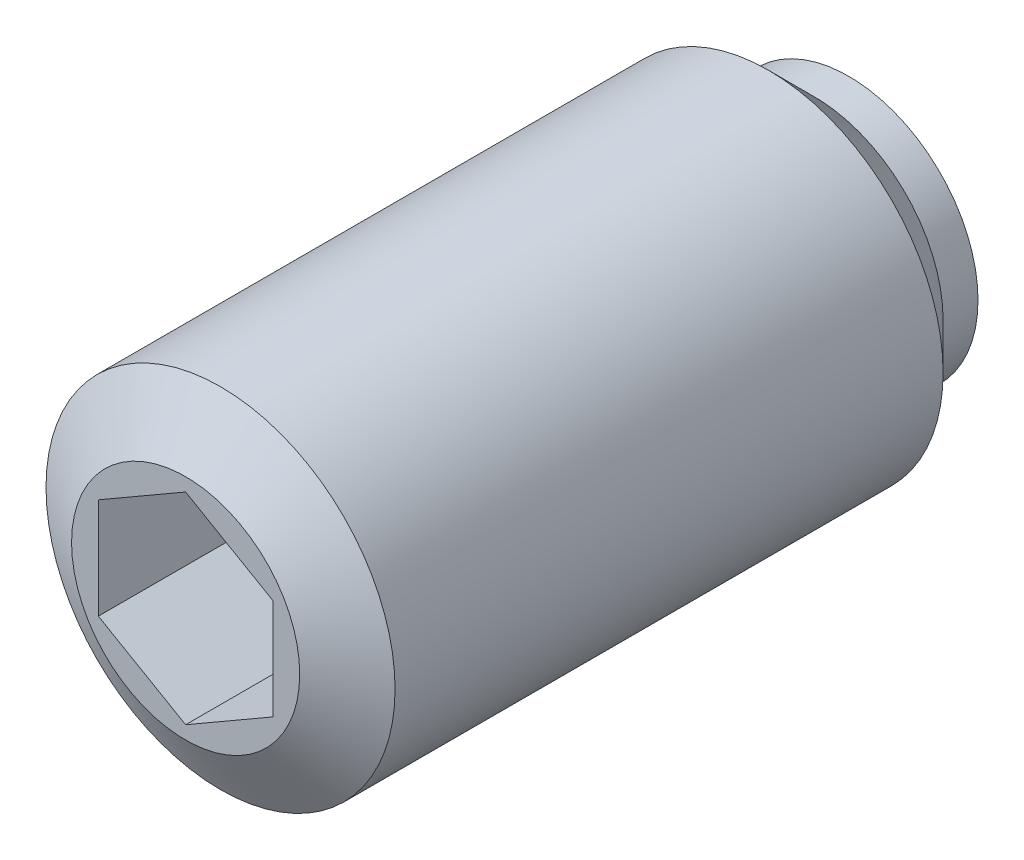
ISO-10303-21;
HEADER;
FILE_DESCRIPTION(('STEP AP214'),'2;1');
FILE_NAME('part.step','',(''),(''),'','','');
FILE_SCHEMA(('AUTOMOTIVE_DESIGN { 1 0 10303 214 1 1 1 1 }'));
ENDSEC;
DATA;
#1=APPLICATION_CONTEXT('core data for automotive mechanical design processes');
#2=APPLICATION_PROTOCOL_DEFINITION('international standard','automotive_design',2000,#1);
#3=PRODUCT_CONTEXT('',#1,'mechanical');
#4=PRODUCT('Part','Part','',(#3));
#5=PRODUCT_RELATED_PRODUCT_CATEGORY('part','',(#4));
#6=PRODUCT_DEFINITION_FORMATION('','',#4);
#7=PRODUCT_DEFINITION_CONTEXT('part definition',#1,'design');
#8=PRODUCT_DEFINITION('design','',#6,#7);
#9=PRODUCT_DEFINITION_SHAPE('','',#8);
#10=(LENGTH_UNIT() NAMED_UNIT(*) SI_UNIT(.MILLI.,.METRE.));
#11=(NAMED_UNIT(*) PLANE_ANGLE_UNIT() SI_UNIT($,.RADIAN.));
#12=(NAMED_UNIT(*) SI_UNIT($,.STERADIAN.) SOLID_ANGLE_UNIT());
#13=UNCERTAINTY_MEASURE_WITH_UNIT(LENGTH_MEASURE(1.E-05),#10,'distance_accuracy_value','');
#14=(GEOMETRIC_REPRESENTATION_CONTEXT(3) GLOBAL_UNCERTAINTY_ASSIGNED_CONTEXT((#13)) GLOBAL_UNIT_ASSIGNED_CONTEXT((#10,
#11,#12)) REPRESENTATION_CONTEXT('',''));
#15=CARTESIAN_POINT('',(0.,0.,0.));
#16=DIRECTION('',(0.,0.,1.));
#17=DIRECTION('',(1.,0.,0.));
#18=AXIS2_PLACEMENT_3D('',#15,#16,#17);
#19=CARTESIAN_POINT('',(0.,1.01980390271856,0.));
#20=DIRECTION('',(0.,0.,1.));
#21=DIRECTION('',(-1.,0.,0.));
#22=AXIS2_PLACEMENT_3D('',#19,#20,#21);
#23=PLANE('',#22);
#24=CARTESIAN_POINT('',(0.,0.,0.));
#25=DIRECTION('',(0.,0.,1.));
#26=DIRECTION('',(-1.,0.,0.));
#27=AXIS2_PLACEMENT_3D('',#24,#25,#26);
#28=CIRCLE('',#27,1.01980390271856);
#29=CARTESIAN_POINT('',(0.,1.01980390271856,0.));
#30=VERTEX_POINT('',#29);
#31=EDGE_CURVE('E9',#30,#30,#28,.T.);
#32=ORIENTED_EDGE('',*,*,#31,.F.);
#33=EDGE_LOOP('',(#32));
#34=FACE_BOUND('',#33,.T.);
#35=ADVANCED_FACE('F14',(#34),#23,.F.);
#36=CARTESIAN_POINT('',(0.,0.,1.1));
#37=DIRECTION('',(0.,0.,1.));
#38=DIRECTION('',(0.,1.,0.));
#39=AXIS2_PLACEMENT_3D('',#36,#37,#38);
#40=SPHERICAL_SURFACE('',#39,1.5);
#41=CARTESIAN_POINT('',(0.,0.,0.3));
#42=DIRECTION('',(0.,0.,1.));
#43=DIRECTION('',(-1.,0.,0.));
#44=AXIS2_PLACEMENT_3D('',#41,#42,#43);
#45=CIRCLE('',#44,1.26885775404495);
#46=CARTESIAN_POINT('',(0.,1.26885775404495,0.3));
#47=VERTEX_POINT('',#46);
#48=EDGE_CURVE('E21',#47,#47,#45,.T.);
#49=CARTESIAN_POINT('',(0.,1.26885775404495,0.3));
#50=CARTESIAN_POINT('',(0.,1.26668545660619,0.296554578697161));
#51=CARTESIAN_POINT('',(0.,1.26449912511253,0.293118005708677));
#52=CARTESIAN_POINT('',(0.,1.26009854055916,0.286262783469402));
#53=CARTESIAN_POINT('',(0.,1.25788428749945,0.28284413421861));
#54=CARTESIAN_POINT('',(0.,1.25342800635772,0.276024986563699));
#55=CARTESIAN_POINT('',(0.,1.2511859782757,0.27262448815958));
#56=CARTESIAN_POINT('',(0.,1.24667429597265,0.265841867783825));
#57=CARTESIAN_POINT('',(0.,1.24440464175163,0.26245974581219));
#58=CARTESIAN_POINT('',(0.,1.23983785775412,0.255714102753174));
#59=CARTESIAN_POINT('',(0.,1.23754072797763,0.252350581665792));
#60=CARTESIAN_POINT('',(0.,1.23291914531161,0.245642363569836));
#61=CARTESIAN_POINT('',(0.,1.23059469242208,0.242297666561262));
#62=CARTESIAN_POINT('',(0.,1.22591861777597,0.235627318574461));
#63=CARTESIAN_POINT('',(0.,1.2235669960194,0.232301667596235));
#64=CARTESIAN_POINT('',(0.,1.21883673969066,0.225669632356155));
#65=CARTESIAN_POINT('',(0.,1.21645810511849,0.222363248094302));
#66=CARTESIAN_POINT('',(0.,1.21167398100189,0.215769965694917));
#67=CARTESIAN_POINT('',(0.,1.20926849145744,0.212483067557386));
#68=CARTESIAN_POINT('',(0.,1.20443081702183,0.205928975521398));
#69=CARTESIAN_POINT('',(0.,1.20199863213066,0.202661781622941));
#70=CARTESIAN_POINT('',(0.,1.19710772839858,0.196147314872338));
#71=CARTESIAN_POINT('',(0.,1.19464900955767,0.192900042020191));
#72=CARTESIAN_POINT('',(0.,1.18970520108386,0.186425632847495));
#73=CARTESIAN_POINT('',(0.,1.18722011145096,0.183198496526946));
#74=CARTESIAN_POINT('',(0.,1.18222372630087,0.176764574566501));
#75=CARTESIAN_POINT('',(0.,1.17971243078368,0.173557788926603));
#76=CARTESIAN_POINT('',(0.,1.17466380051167,0.167164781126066));
#77=CARTESIAN_POINT('',(0.,1.17212646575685,0.163978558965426));
#78=CARTESIAN_POINT('',(0.,1.16702592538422,0.157626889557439));
#79=CARTESIAN_POINT('',(0.,1.16446271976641,0.154461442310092));
#80=CARTESIAN_POINT('',(0.,1.15931060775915,0.148151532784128));
#81=CARTESIAN_POINT('',(0.,1.15672170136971,0.145007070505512));
#82=CARTESIAN_POINT('',(0.,1.15151835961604,0.138739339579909));
#83=CARTESIAN_POINT('',(0.,1.14890392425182,0.135616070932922));
#84=CARTESIAN_POINT('',(0.,1.14364969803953,0.129390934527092));
#85=CARTESIAN_POINT('',(0.,1.14100990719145,0.126289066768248));
#86=CARTESIAN_POINT('',(0.,1.13570514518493,0.120106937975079));
#87=CARTESIAN_POINT('',(0.,1.13304017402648,0.117026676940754));
#88=CARTESIAN_POINT('',(0.,1.12768522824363,0.1108879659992));
#89=CARTESIAN_POINT('',(0.,1.12499525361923,0.107829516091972));
#90=CARTESIAN_POINT('',(0.,1.1195904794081,0.101734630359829));
#91=CARTESIAN_POINT('',(0.,1.11687567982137,0.0986981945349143));
#92=CARTESIAN_POINT('',(0.,1.11142143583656,0.0926475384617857));
#93=CARTESIAN_POINT('',(0.,1.10868199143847,0.0896333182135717));
#94=CARTESIAN_POINT('',(0.,1.10317863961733,0.0836272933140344));
#95=CARTESIAN_POINT('',(0.,1.10041473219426,0.080635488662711));
#96=CARTESIAN_POINT('',(0.,1.09486263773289,0.0746744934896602));
#97=CARTESIAN_POINT('',(0.,1.09207445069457,0.0717053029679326));
#98=CARTESIAN_POINT('',(0.,1.08647398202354,0.0657897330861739));
#99=CARTESIAN_POINT('',(0.,1.08366170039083,0.0628433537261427));
#100=CARTESIAN_POINT('',(0.,1.07801322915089,0.0569736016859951));
#101=CARTESIAN_POINT('',(0.,1.07517703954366,0.0540502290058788));
#102=CARTESIAN_POINT('',(0.,1.06948094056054,0.0482266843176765));
#103=CARTESIAN_POINT('',(0.,1.06662103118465,0.0453265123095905));
#104=CARTESIAN_POINT('',(0.,1.06087768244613,0.0395495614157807));
#105=CARTESIAN_POINT('',(0.,1.0579942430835,0.036672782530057));
#106=CARTESIAN_POINT('',(0.,1.0522040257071,0.0309428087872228));
#107=CARTESIAN_POINT('',(0.,1.04929724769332,0.0280896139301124));
#108=CARTESIAN_POINT('',(0.,1.04346054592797,0.0224069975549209));
#109=CARTESIAN_POINT('',(0.,1.0405306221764,0.01957757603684));
#110=CARTESIAN_POINT('',(0.,1.03464782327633,0.013942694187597));
#111=CARTESIAN_POINT('',(0.,1.03169494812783,0.011137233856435));
#112=CARTESIAN_POINT('',(0.,1.02576644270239,0.00555046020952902));
#113=CARTESIAN_POINT('',(0.,1.02279081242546,0.00276914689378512));
#114=CARTESIAN_POINT('',(0.,1.01980390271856,0.));
#115=B_SPLINE_CURVE_WITH_KNOTS('',3,(#49,#50,#51,#52,#53,#54,#55,#56,#57,#58,#59,#60,#61,#62,
#63,#64,#65,#66,#67,#68,#69,#70,#71,#72,#73,#74,#75,#76,#77,#78,#79,#80,#81,#82,#83,#84,#85,#86,
#87,#88,#89,#90,#91,#92,#93,#94,#95,#96,#97,#98,#99,#100,#101,#102,#103,#104,#105,#106,#107,
#108,#109,#110,#111,#112,#113,#114),.UNSPECIFIED.,.F.,.F.,(4,2,2,2,2,2,2,2,2,2,2,2,2,2,2,2,2,2,
2,2,2,2,2,2,2,2,2,2,2,2,2,2,4),(0.,0.0122191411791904,0.0244382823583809,0.0366574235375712,
0.0488765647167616,0.061095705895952,0.0733148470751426,0.0855339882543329,0.0977531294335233,
0.109972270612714,0.122191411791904,0.134410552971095,0.146629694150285,0.158848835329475,
0.171067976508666,0.183287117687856,0.195506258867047,0.207725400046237,0.219944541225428,
0.232163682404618,0.244382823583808,0.256601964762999,0.268821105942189,0.281040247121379,
0.29325938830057,0.30547852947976,0.317697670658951,0.329916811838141,0.342135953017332,
0.354355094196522,0.366574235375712,0.378793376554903,0.391012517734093),.UNSPECIFIED.);
#116=EDGE_CURVE('BSEAM141',#47,#30,#115,.T.);
#117=ORIENTED_EDGE('',*,*,#48,.F.);
#118=ORIENTED_EDGE('',*,*,#31,.T.);
#119=ORIENTED_EDGE('',*,*,#116,.T.);
#120=ORIENTED_EDGE('',*,*,#116,.F.);
#121=EDGE_LOOP('',(#117,#119,#118,#120));
#122=FACE_BOUND('',#121,.T.);
#123=ADVANCED_FACE('F141',(#122),#40,.T.);
#124=CARTESIAN_POINT('',(0.,1.85,0.3));
#125=DIRECTION('',(0.,0.,1.));
#126=DIRECTION('',(-1.,0.,0.));
#127=AXIS2_PLACEMENT_3D('',#124,#125,#126);
#128=PLANE('',#127);
#129=CARTESIAN_POINT('',(0.,0.,0.3));
#130=DIRECTION('',(0.,0.,1.));
#131=DIRECTION('',(-1.,0.,0.));
#132=AXIS2_PLACEMENT_3D('',#129,#130,#131);
#133=CIRCLE('',#132,1.85);
#134=CARTESIAN_POINT('',(-1.85,0.,0.3));
#135=VERTEX_POINT('',#134);
#136=EDGE_CURVE('E134',#135,#135,#133,.T.);
#137=ORIENTED_EDGE('',*,*,#136,.F.);
#138=EDGE_LOOP('',(#137));
#139=FACE_BOUND('',#138,.T.);
#140=ORIENTED_EDGE('',*,*,#48,.T.);
#141=EDGE_LOOP('',(#140));
#142=FACE_BOUND('',#141,.T.);
#143=ADVANCED_FACE('F139',(#139,#142),#128,.F.);
#144=CARTESIAN_POINT('',(0.,0.,11.1950749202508));
#145=DIRECTION('',(0.,0.,1.));
#146=DIRECTION('',(-1.,0.,0.));
#147=AXIS2_PLACEMENT_3D('',#144,#145,#146);
#148=CYLINDRICAL_SURFACE('',#147,1.85);
#149=CARTESIAN_POINT('',(0.,0.,0.8));
#150=DIRECTION('',(0.,0.,1.));
#151=DIRECTION('',(-1.,0.,0.));
#152=AXIS2_PLACEMENT_3D('',#149,#150,#151);
#153=CIRCLE('',#152,1.85);
#154=CARTESIAN_POINT('',(-1.85,0.,0.8));
#155=VERTEX_POINT('',#154);
#156=EDGE_CURVE('E131',#155,#155,#153,.T.);
#157=ORIENTED_EDGE('',*,*,#156,.F.);
#158=EDGE_LOOP('',(#157));
#159=FACE_BOUND('',#158,.T.);
#160=ORIENTED_EDGE('',*,*,#136,.T.);
#161=EDGE_LOOP('',(#160));
#162=FACE_BOUND('',#161,.T.);
#163=ADVANCED_FACE('F164',(#159,#162),#148,.T.);
#164=CARTESIAN_POINT('',(0.,0.,0.8));
#165=DIRECTION('',(0.,0.,1.));
#166=DIRECTION('',(-1.,0.,0.));
#167=AXIS2_PLACEMENT_3D('',#164,#165,#166);
#168=CONICAL_SURFACE('',#167,1.85,0.78539816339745);
#169=CARTESIAN_POINT('',(0.,0.,1.45));
#170=DIRECTION('',(0.,0.,1.));
#171=DIRECTION('',(-1.,0.,0.));
#172=AXIS2_PLACEMENT_3D('',#169,#170,#171);
#173=CIRCLE('',#172,2.5);
#174=CARTESIAN_POINT('',(-2.5,0.,1.45));
#175=VERTEX_POINT('',#174);
#176=EDGE_CURVE('E128',#175,#175,#173,.T.);
#177=ORIENTED_EDGE('',*,*,#176,.F.);
#178=EDGE_LOOP('',(#177));
#179=FACE_BOUND('',#178,.T.);
#180=ORIENTED_EDGE('',*,*,#156,.T.);
#181=EDGE_LOOP('',(#180));
#182=FACE_BOUND('',#181,.T.);
#183=ADVANCED_FACE('F173',(#179,#182),#168,.T.);
#184=CARTESIAN_POINT('',(0.,0.,11.1950749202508));
#185=DIRECTION('',(0.,0.,1.));
#186=DIRECTION('',(-1.,0.,0.));
#187=AXIS2_PLACEMENT_3D('',#184,#185,#186);
#188=CYLINDRICAL_SURFACE('',#187,2.5);
#189=CARTESIAN_POINT('',(0.,0.,9.3));
#190=DIRECTION('',(0.,0.,1.));
#191=DIRECTION('',(-1.,0.,0.));
#192=AXIS2_PLACEMENT_3D('',#189,#190,#191);
#193=CIRCLE('',#192,2.5);
#194=CARTESIAN_POINT('',(-2.5,0.,9.3));
#195=VERTEX_POINT('',#194);
#196=EDGE_CURVE('E125',#195,#195,#193,.T.);
#197=ORIENTED_EDGE('',*,*,#196,.F.);
#198=EDGE_LOOP('',(#197));
#199=FACE_BOUND('',#198,.T.);
#200=ORIENTED_EDGE('',*,*,#176,.T.);
#201=EDGE_LOOP('',(#200));
#202=FACE_BOUND('',#201,.T.);
#203=ADVANCED_FACE('F182',(#199,#202),#188,.T.);
#204=CARTESIAN_POINT('',(0.,0.,9.3));
#205=DIRECTION('',(0.,0.,-1.));
#206=DIRECTION('',(1.,0.,0.));
#207=AXIS2_PLACEMENT_3D('',#204,#205,#206);
#208=CONICAL_SURFACE('',#207,2.5,1.04719755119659);
#209=CARTESIAN_POINT('',(0.,0.,9.8));
#210=DIRECTION('',(0.,0.,1.));
#211=DIRECTION('',(-1.,0.,0.));
#212=AXIS2_PLACEMENT_3D('',#209,#210,#211);
#213=CIRCLE('',#212,1.63397459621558);
#214=CARTESIAN_POINT('',(-1.63397459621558,0.,9.8));
#215=VERTEX_POINT('',#214);
#216=EDGE_CURVE('E116',#215,#215,#213,.T.);
#217=ORIENTED_EDGE('',*,*,#216,.F.);
#218=EDGE_LOOP('',(#217));
#219=FACE_BOUND('',#218,.T.);
#220=ORIENTED_EDGE('',*,*,#196,.T.);
#221=EDGE_LOOP('',(#220));
#222=FACE_BOUND('',#221,.T.);
#223=ADVANCED_FACE('F191',(#219,#222),#208,.T.);
#224=CARTESIAN_POINT('',(0.,0.,9.8));
#225=DIRECTION('',(0.,0.,-1.));
#226=DIRECTION('',(1.,0.,0.));
#227=AXIS2_PLACEMENT_3D('',#224,#225,#226);
#228=PLANE('',#227);
#229=DIRECTION('',(-0.866025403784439,-0.5,0.));
#230=VECTOR('',#229,1.);
#231=CARTESIAN_POINT('',(0.,1.44337567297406,9.8));
#232=LINE('',#231,#230);
#233=CARTESIAN_POINT('',(0.,1.44337567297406,9.8));
#234=VERTEX_POINT('',#233);
#235=CARTESIAN_POINT('',(-1.25,0.721687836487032,9.8));
#236=VERTEX_POINT('',#235);
#237=EDGE_CURVE('E82',#234,#236,#232,.T.);
#238=ORIENTED_EDGE('',*,*,#237,.F.);
#239=DIRECTION('',(-0.866025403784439,0.5,0.));
#240=VECTOR('',#239,1.);
#241=CARTESIAN_POINT('',(1.25,0.721687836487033,9.8));
#242=LINE('',#241,#240);
#243=CARTESIAN_POINT('',(1.25,0.721687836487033,9.8));
#244=VERTEX_POINT('',#243);
#245=EDGE_CURVE('E28',#244,#234,#242,.T.);
#246=ORIENTED_EDGE('',*,*,#245,.F.);
#247=DIRECTION('',(0.,1.,0.));
#248=VECTOR('',#247,1.);
#249=CARTESIAN_POINT('',(1.25,-0.721687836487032,9.8));
#250=LINE('',#249,#248);
#251=CARTESIAN_POINT('',(1.25,-0.721687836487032,9.8));
#252=VERTEX_POINT('',#251);
#253=EDGE_CURVE('E98',#252,#244,#250,.T.);
#254=ORIENTED_EDGE('',*,*,#253,.F.);
#255=DIRECTION('',(0.866025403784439,0.5,0.));
#256=VECTOR('',#255,1.);
#257=CARTESIAN_POINT('',(0.,-1.44337567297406,9.8));
#258=LINE('',#257,#256);
#259=CARTESIAN_POINT('',(0.,-1.44337567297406,9.8));
#260=VERTEX_POINT('',#259);
#261=EDGE_CURVE('E92',#260,#252,#258,.T.);
#262=ORIENTED_EDGE('',*,*,#261,.F.);
#263=DIRECTION('',(0.866025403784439,-0.5,0.));
#264=VECTOR('',#263,1.);
#265=CARTESIAN_POINT('',(-1.25,-0.721687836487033,9.8));
#266=LINE('',#265,#264);
#267=CARTESIAN_POINT('',(-1.25,-0.721687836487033,9.8));
#268=VERTEX_POINT('',#267);
#269=EDGE_CURVE('E90',#268,#260,#266,.T.);
#270=ORIENTED_EDGE('',*,*,#269,.F.);
#271=DIRECTION('',(0.,-1.,0.));
#272=VECTOR('',#271,1.);
#273=CARTESIAN_POINT('',(-1.25,0.721687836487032,9.8));
#274=LINE('',#273,#272);
#275=EDGE_CURVE('E71',#236,#268,#274,.T.);
#276=ORIENTED_EDGE('',*,*,#275,.F.);
#277=EDGE_LOOP('',(#238,#246,#254,#262,#270,#276));
#278=FACE_BOUND('',#277,.T.);
#279=ORIENTED_EDGE('',*,*,#216,.T.);
#280=EDGE_LOOP('',(#279));
#281=FACE_BOUND('',#280,.T.);
#282=ADVANCED_FACE('F86',(#278,#281),#228,.F.);
#283=CARTESIAN_POINT('',(1.25,0.721687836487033,6.8));
#284=DIRECTION('',(0.5,0.866025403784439,0.));
#285=DIRECTION('',(0.866025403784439,-0.5,0.));
#286=AXIS2_PLACEMENT_3D('',#283,#284,#285);
#287=PLANE('',#286);
#288=ORIENTED_EDGE('',*,*,#245,.T.);
#289=DIRECTION('',(0.,0.,1.));
#290=VECTOR('',#289,1.);
#291=CARTESIAN_POINT('',(0.,1.44337567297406,6.8));
#292=LINE('',#291,#290);
#293=CARTESIAN_POINT('',(0.,1.44337567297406,6.8));
#294=VERTEX_POINT('',#293);
#295=EDGE_CURVE('E79',#294,#234,#292,.T.);
#296=ORIENTED_EDGE('',*,*,#295,.F.);
#297=DIRECTION('',(-0.866025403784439,0.5,0.));
#298=VECTOR('',#297,1.);
#299=CARTESIAN_POINT('',(1.25,0.721687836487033,6.8));
#300=LINE('',#299,#298);
#301=CARTESIAN_POINT('',(1.25,0.721687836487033,6.8));
#302=VERTEX_POINT('',#301);
#303=EDGE_CURVE('E100',#302,#294,#300,.T.);
#304=ORIENTED_EDGE('',*,*,#303,.F.);
#305=DIRECTION('',(0.,0.,1.));
#306=VECTOR('',#305,1.);
#307=CARTESIAN_POINT('',(1.25,0.721687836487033,6.8));
#308=LINE('',#307,#306);
#309=EDGE_CURVE('E35',#302,#244,#308,.T.);
#310=ORIENTED_EDGE('',*,*,#309,.T.);
#311=EDGE_LOOP('',(#288,#296,#304,#310));
#312=FACE_BOUND('',#311,.T.);
#313=ADVANCED_FACE('F208',(#312),#287,.F.);
#314=CARTESIAN_POINT('',(1.25,-0.721687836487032,6.8));
#315=DIRECTION('',(1.,0.,0.));
#316=DIRECTION('',(0.,-1.,0.));
#317=AXIS2_PLACEMENT_3D('',#314,#315,#316);
#318=PLANE('',#317);
#319=ORIENTED_EDGE('',*,*,#253,.T.);
#320=ORIENTED_EDGE('',*,*,#309,.F.);
#321=DIRECTION('',(0.,1.,0.));
#322=VECTOR('',#321,1.);
#323=CARTESIAN_POINT('',(1.25,-0.721687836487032,6.8));
#324=LINE('',#323,#322);
#325=CARTESIAN_POINT('',(1.25,-0.721687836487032,6.8));
#326=VERTEX_POINT('',#325);
#327=EDGE_CURVE('E112',#326,#302,#324,.T.);
#328=ORIENTED_EDGE('',*,*,#327,.F.);
#329=DIRECTION('',(0.,0.,1.));
#330=VECTOR('',#329,1.);
#331=CARTESIAN_POINT('',(1.25,-0.721687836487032,6.8));
#332=LINE('',#331,#330);
#333=EDGE_CURVE('E117',#326,#252,#332,.T.);
#334=ORIENTED_EDGE('',*,*,#333,.T.);
#335=EDGE_LOOP('',(#319,#320,#328,#334));
#336=FACE_BOUND('',#335,.T.);
#337=ADVANCED_FACE('F216',(#336),#318,.F.);
#338=CARTESIAN_POINT('',(0.,-1.44337567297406,6.8));
#339=DIRECTION('',(0.5,-0.866025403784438,0.));
#340=DIRECTION('',(-0.866025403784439,-0.5,0.));
#341=AXIS2_PLACEMENT_3D('',#338,#339,#340);
#342=PLANE('',#341);
#343=ORIENTED_EDGE('',*,*,#261,.T.);
#344=ORIENTED_EDGE('',*,*,#333,.F.);
#345=DIRECTION('',(0.866025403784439,0.5,0.));
#346=VECTOR('',#345,1.);
#347=CARTESIAN_POINT('',(0.,-1.44337567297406,6.8));
#348=LINE('',#347,#346);
#349=CARTESIAN_POINT('',(0.,-1.44337567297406,6.8));
#350=VERTEX_POINT('',#349);
#351=EDGE_CURVE('E109',#350,#326,#348,.T.);
#352=ORIENTED_EDGE('',*,*,#351,.F.);
#353=DIRECTION('',(0.,0.,1.));
#354=VECTOR('',#353,1.);
#355=CARTESIAN_POINT('',(0.,-1.44337567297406,6.8));
#356=LINE('',#355,#354);
#357=EDGE_CURVE('E119',#350,#260,#356,.T.);
#358=ORIENTED_EDGE('',*,*,#357,.T.);
#359=EDGE_LOOP('',(#343,#344,#352,#358));
#360=FACE_BOUND('',#359,.T.);
#361=ADVANCED_FACE('F224',(#360),#342,.F.);
#362=CARTESIAN_POINT('',(-1.25,-0.721687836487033,6.8));
#363=DIRECTION('',(-0.5,-0.866025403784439,0.));
#364=DIRECTION('',(-0.866025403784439,0.5,0.));
#365=AXIS2_PLACEMENT_3D('',#362,#363,#364);
#366=PLANE('',#365);
#367=ORIENTED_EDGE('',*,*,#269,.T.);
#368=ORIENTED_EDGE('',*,*,#357,.F.);
#369=DIRECTION('',(0.866025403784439,-0.5,0.));
#370=VECTOR('',#369,1.);
#371=CARTESIAN_POINT('',(-1.25,-0.721687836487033,6.8));
#372=LINE('',#371,#370);
#373=CARTESIAN_POINT('',(-1.25,-0.721687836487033,6.8));
#374=VERTEX_POINT('',#373);
#375=EDGE_CURVE('E106',#374,#350,#372,.T.);
#376=ORIENTED_EDGE('',*,*,#375,.F.);
#377=DIRECTION('',(0.,0.,1.));
#378=VECTOR('',#377,1.);
#379=CARTESIAN_POINT('',(-1.25,-0.721687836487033,6.8));
#380=LINE('',#379,#378);
#381=EDGE_CURVE('E78',#374,#268,#380,.T.);
#382=ORIENTED_EDGE('',*,*,#381,.T.);
#383=EDGE_LOOP('',(#367,#368,#376,#382));
#384=FACE_BOUND('',#383,.T.);
#385=ADVANCED_FACE('F232',(#384),#366,.F.);
#386=CARTESIAN_POINT('',(-1.25,0.721687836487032,6.8));
#387=DIRECTION('',(-1.,0.,0.));
#388=DIRECTION('',(0.,1.,0.));
#389=AXIS2_PLACEMENT_3D('',#386,#387,#388);
#390=PLANE('',#389);
#391=ORIENTED_EDGE('',*,*,#275,.T.);
#392=ORIENTED_EDGE('',*,*,#381,.F.);
#393=DIRECTION('',(0.,-1.,0.));
#394=VECTOR('',#393,1.);
#395=CARTESIAN_POINT('',(-1.25,0.721687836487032,6.8));
#396=LINE('',#395,#394);
#397=CARTESIAN_POINT('',(-1.25,0.721687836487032,6.8));
#398=VERTEX_POINT('',#397);
#399=EDGE_CURVE('E74',#398,#374,#396,.T.);
#400=ORIENTED_EDGE('',*,*,#399,.F.);
#401=DIRECTION('',(0.,0.,1.));
#402=VECTOR('',#401,1.);
#403=CARTESIAN_POINT('',(-1.25,0.721687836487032,6.8));
#404=LINE('',#403,#402);
#405=EDGE_CURVE('E67',#398,#236,#404,.T.);
#406=ORIENTED_EDGE('',*,*,#405,.T.);
#407=EDGE_LOOP('',(#391,#392,#400,#406));
#408=FACE_BOUND('',#407,.T.);
#409=ADVANCED_FACE('F69',(#408),#390,.F.);
#410=CARTESIAN_POINT('',(0.,1.44337567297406,6.8));
#411=DIRECTION('',(-0.5,0.866025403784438,0.));
#412=DIRECTION('',(0.866025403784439,0.5,0.));
#413=AXIS2_PLACEMENT_3D('',#410,#411,#412);
#414=PLANE('',#413);
#415=ORIENTED_EDGE('',*,*,#237,.T.);
#416=ORIENTED_EDGE('',*,*,#405,.F.);
#417=DIRECTION('',(-0.866025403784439,-0.5,0.));
#418=VECTOR('',#417,1.);
#419=CARTESIAN_POINT('',(0.,1.44337567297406,6.8));
#420=LINE('',#419,#418);
#421=EDGE_CURVE('E103',#294,#398,#420,.T.);
#422=ORIENTED_EDGE('',*,*,#421,.F.);
#423=ORIENTED_EDGE('',*,*,#295,.T.);
#424=EDGE_LOOP('',(#415,#416,#422,#423));
#425=FACE_BOUND('',#424,.T.);
#426=ADVANCED_FACE('F83',(#425),#414,.F.);
#427=CARTESIAN_POINT('',(2.5,0.,6.8));
#428=DIRECTION('',(0.,0.,-1.));
#429=DIRECTION('',(1.,0.,0.));
#430=AXIS2_PLACEMENT_3D('',#427,#428,#429);
#431=PLANE('',#430);
#432=ORIENTED_EDGE('',*,*,#303,.T.);
#433=ORIENTED_EDGE('',*,*,#421,.T.);
#434=ORIENTED_EDGE('',*,*,#399,.T.);
#435=ORIENTED_EDGE('',*,*,#375,.T.);
#436=ORIENTED_EDGE('',*,*,#351,.T.);
#437=ORIENTED_EDGE('',*,*,#327,.T.);
#438=EDGE_LOOP('',(#432,#433,#434,#435,#436,#437));
#439=FACE_BOUND('',#438,.T.);
#440=ADVANCED_FACE('F256',(#439),#431,.F.);
#441=CLOSED_SHELL('',(#35,#123,#143,#163,#183,#203,#223,#282,#313,#337,#361,#385,#409,#426,#440));
#442=MANIFOLD_SOLID_BREP('B1',#441);
#443=ADVANCED_BREP_SHAPE_REPRESENTATION('',(#18,#442),#14);
#444=SHAPE_DEFINITION_REPRESENTATION(#9,#443);
ENDSEC;
END-ISO-10303-21;
